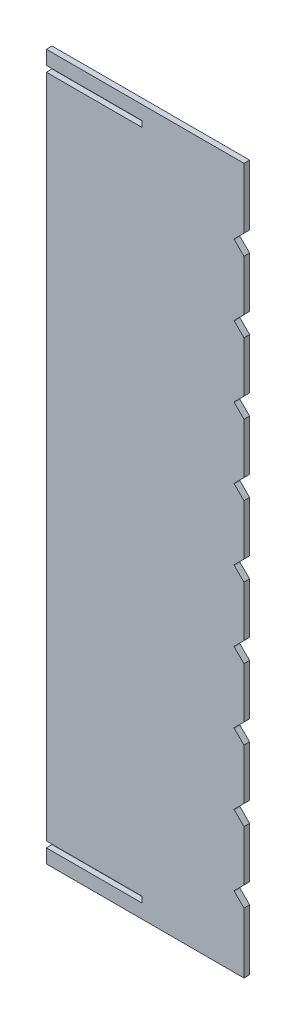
from build123d import *

# Parameters (mm, degrees)
EXTRUDE_1_DEPTH = 4


with BuildPart() as part:
    # Model → Extrude 1 (new body)
    with BuildSketch(Plane.XY):
        Polygon((-2502.5465, -558.8025), (-2502.5465, -594.6603), (-2502.8805, -594.9941), (-2503.2562, -595.3699), (-2509.6178, -601.7314), (-2509.2838, -602.0653), (-2502.5465, -608.8025), (-2502.5465, -644.6603), (-2502.8805, -644.9941), (-2503.2562, -645.3699), (-2509.6178, -651.7314), (-2509.2838, -652.0653), (-2502.5465, -658.8025), (-2502.5465, -694.6603), (-2502.8805, -694.9941), (-2503.2562, -695.3699), (-2509.6178, -701.7314), (-2509.2838, -702.0653), (-2502.5465, -708.8025), (-2502.5465, -744.6603), (-2502.8805, -744.9941), (-2503.2562, -745.3699), (-2509.6178, -751.7314), (-2509.2838, -752.0653), (-2502.5465, -758.8025), (-2502.5465, -794.6604), (-2502.8805, -794.9943), (-2509.6178, -801.7314), (-2509.2838, -802.0654), (-2502.5465, -808.8025), (-2502.5465, -844.6604), (-2502.8805, -844.9943), (-2509.6178, -851.7314), (-2509.2838, -852.0654), (-2502.5465, -858.8025), (-2502.5465, -901.7314), (-2642.5468, -901.7314), (-2642.5468, -891.8314), (-2574.8947, -891.8314), (-2574.8947, -891.7314), (-2574.8947, -887.7314), (-2574.8947, -887.6314), (-2642.5468, -887.6314), (-2642.5468, -415.8314), (-2574.8949, -415.8314), (-2574.8949, -415.7314), (-2574.8949, -411.7314), (-2574.8949, -411.6314), (-2642.5468, -411.6314), (-2642.5468, -401.7314), (-2502.5465, -401.7314), (-2502.5465, -444.6604), (-2502.8805, -444.9943), (-2509.6178, -451.7314), (-2509.2838, -452.0654), (-2502.5465, -458.8025), (-2502.5465, -494.6604), (-2502.8805, -494.9943), (-2509.6178, -501.7314), (-2509.2838, -502.0654), (-2502.5465, -508.8025), (-2502.5465, -544.6603), (-2502.8805, -544.9941), (-2503.2562, -545.3699), (-2509.6178, -551.7314), (-2509.2838, -552.0653), align=None)
    extrude(amount=EXTRUDE_1_DEPTH)


solid = part.part
